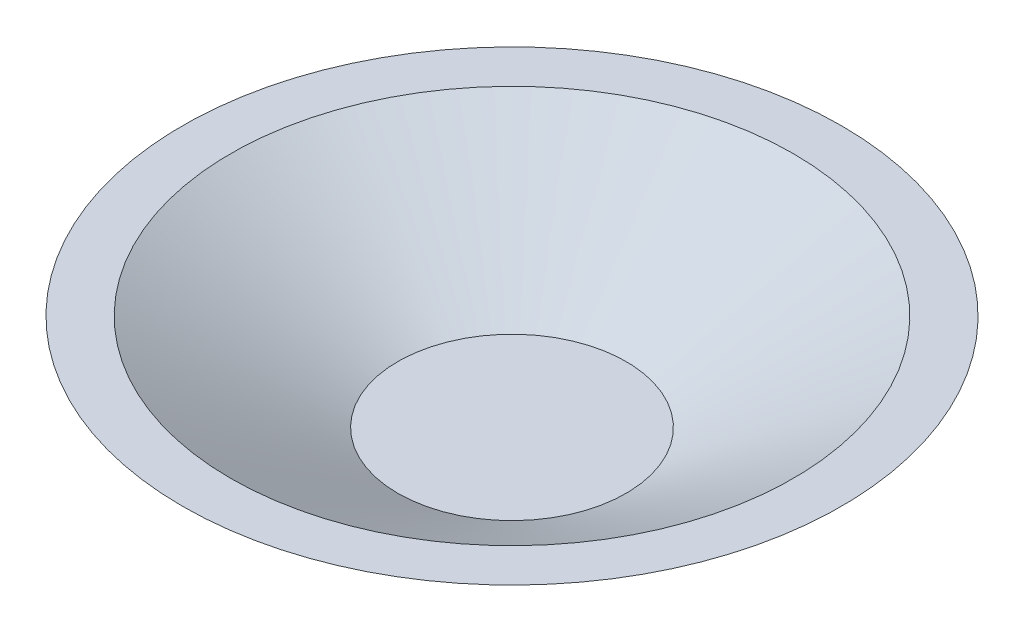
ISO-10303-21;
HEADER;
FILE_DESCRIPTION(('STEP AP214'),'2;1');
FILE_NAME('part.step','',(''),(''),'','','');
FILE_SCHEMA(('AUTOMOTIVE_DESIGN { 1 0 10303 214 1 1 1 1 }'));
ENDSEC;
DATA;
#1=APPLICATION_CONTEXT('core data for automotive mechanical design processes');
#2=APPLICATION_PROTOCOL_DEFINITION('international standard','automotive_design',2000,#1);
#3=PRODUCT_CONTEXT('',#1,'mechanical');
#4=PRODUCT('Part','Part','',(#3));
#5=PRODUCT_RELATED_PRODUCT_CATEGORY('part','',(#4));
#6=PRODUCT_DEFINITION_FORMATION('','',#4);
#7=PRODUCT_DEFINITION_CONTEXT('part definition',#1,'design');
#8=PRODUCT_DEFINITION('design','',#6,#7);
#9=PRODUCT_DEFINITION_SHAPE('','',#8);
#10=(LENGTH_UNIT() NAMED_UNIT(*) SI_UNIT(.MILLI.,.METRE.));
#11=(NAMED_UNIT(*) PLANE_ANGLE_UNIT() SI_UNIT($,.RADIAN.));
#12=(NAMED_UNIT(*) SI_UNIT($,.STERADIAN.) SOLID_ANGLE_UNIT());
#13=UNCERTAINTY_MEASURE_WITH_UNIT(LENGTH_MEASURE(1.E-05),#10,'distance_accuracy_value','');
#14=(GEOMETRIC_REPRESENTATION_CONTEXT(3) GLOBAL_UNCERTAINTY_ASSIGNED_CONTEXT((#13)) GLOBAL_UNIT_ASSIGNED_CONTEXT((#10,
#11,#12)) REPRESENTATION_CONTEXT('',''));
#15=CARTESIAN_POINT('',(0.,0.,0.));
#16=DIRECTION('',(0.,0.,1.));
#17=DIRECTION('',(1.,0.,0.));
#18=AXIS2_PLACEMENT_3D('',#15,#16,#17);
#19=CARTESIAN_POINT('',(0.,0.,0.));
#20=DIRECTION('',(0.,1.,0.));
#21=DIRECTION('',(0.,0.,1.));
#22=AXIS2_PLACEMENT_3D('',#19,#20,#21);
#23=PLANE('',#22);
#24=CARTESIAN_POINT('',(0.,0.,0.));
#25=DIRECTION('',(0.,-1.,0.));
#26=DIRECTION('',(0.,0.,-1.));
#27=AXIS2_PLACEMENT_3D('',#24,#25,#26);
#28=CIRCLE('',#27,5.);
#29=CARTESIAN_POINT('',(0.,0.,-5.));
#30=VERTEX_POINT('',#29);
#31=EDGE_CURVE('E10',#30,#30,#28,.T.);
#32=ORIENTED_EDGE('',*,*,#31,.T.);
#33=EDGE_LOOP('',(#32));
#34=FACE_BOUND('',#33,.T.);
#35=ADVANCED_FACE('F24',(#34),#23,.F.);
#36=CARTESIAN_POINT('',(0.,5.,0.));
#37=DIRECTION('',(0.,1.,0.));
#38=DIRECTION('',(0.,0.,1.));
#39=AXIS2_PLACEMENT_3D('',#36,#37,#38);
#40=CONICAL_SURFACE('',#39,13.6602540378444,1.0471975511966);
#41=ORIENTED_EDGE('',*,*,#31,.F.);
#42=EDGE_LOOP('',(#41));
#43=FACE_BOUND('',#42,.T.);
#44=CARTESIAN_POINT('',(0.,5.,0.));
#45=DIRECTION('',(0.,-1.,0.));
#46=DIRECTION('',(0.,0.,-1.));
#47=AXIS2_PLACEMENT_3D('',#44,#45,#46);
#48=CIRCLE('',#47,13.6602540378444);
#49=CARTESIAN_POINT('',(0.,5.,-13.6602540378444));
#50=VERTEX_POINT('',#49);
#51=EDGE_CURVE('E30',#50,#50,#48,.T.);
#52=ORIENTED_EDGE('',*,*,#51,.T.);
#53=EDGE_LOOP('',(#52));
#54=FACE_BOUND('',#53,.T.);
#55=ADVANCED_FACE('F59',(#43,#54),#40,.T.);
#56=CARTESIAN_POINT('',(-13.6602540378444,5.,0.));
#57=DIRECTION('',(0.,-1.,0.));
#58=DIRECTION('',(0.,0.,-1.));
#59=AXIS2_PLACEMENT_3D('',#56,#57,#58);
#60=PLANE('',#59);
#61=CARTESIAN_POINT('',(0.,5.,0.));
#62=DIRECTION('',(0.,-1.,0.));
#63=DIRECTION('',(0.,0.,-1.));
#64=AXIS2_PLACEMENT_3D('',#61,#62,#63);
#65=CIRCLE('',#64,11.6602540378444);
#66=CARTESIAN_POINT('',(0.,5.,-11.6602540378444));
#67=VERTEX_POINT('',#66);
#68=EDGE_CURVE('E38',#67,#67,#65,.T.);
#69=ORIENTED_EDGE('',*,*,#68,.T.);
#70=EDGE_LOOP('',(#69));
#71=FACE_BOUND('',#70,.T.);
#72=ORIENTED_EDGE('',*,*,#51,.F.);
#73=EDGE_LOOP('',(#72));
#74=FACE_BOUND('',#73,.T.);
#75=ADVANCED_FACE('F44',(#71,#74),#60,.F.);
#76=CARTESIAN_POINT('',(0.,1.,0.));
#77=DIRECTION('',(0.,1.,0.));
#78=DIRECTION('',(0.,0.,1.));
#79=AXIS2_PLACEMENT_3D('',#76,#77,#78);
#80=PLANE('',#79);
#81=CARTESIAN_POINT('',(0.,1.,0.));
#82=DIRECTION('',(0.,1.,0.));
#83=DIRECTION('',(0.,0.,1.));
#84=AXIS2_PLACEMENT_3D('',#81,#82,#83);
#85=CIRCLE('',#84,4.73205080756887);
#86=CARTESIAN_POINT('',(0.,1.,4.73205080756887));
#87=VERTEX_POINT('',#86);
#88=EDGE_CURVE('E34',#87,#87,#85,.F.);
#89=ORIENTED_EDGE('',*,*,#88,.F.);
#90=EDGE_LOOP('',(#89));
#91=FACE_BOUND('',#90,.T.);
#92=ADVANCED_FACE('F49',(#91),#80,.T.);
#93=CARTESIAN_POINT('',(0.,5.86602540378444,0.));
#94=DIRECTION('',(0.,1.,0.));
#95=DIRECTION('',(0.,0.,1.));
#96=AXIS2_PLACEMENT_3D('',#93,#94,#95);
#97=CONICAL_SURFACE('',#96,13.1602540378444,1.0471975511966);
#98=ORIENTED_EDGE('',*,*,#88,.T.);
#99=EDGE_LOOP('',(#98));
#100=FACE_BOUND('',#99,.T.);
#101=ORIENTED_EDGE('',*,*,#68,.F.);
#102=EDGE_LOOP('',(#101));
#103=FACE_BOUND('',#102,.T.);
#104=ADVANCED_FACE('F47',(#100,#103),#97,.F.);
#105=CLOSED_SHELL('',(#35,#55,#75,#92,#104));
#106=MANIFOLD_SOLID_BREP('B2',#105);
#107=ADVANCED_BREP_SHAPE_REPRESENTATION('',(#18,#106),#14);
#108=SHAPE_DEFINITION_REPRESENTATION(#9,#107);
ENDSEC;
END-ISO-10303-21;
